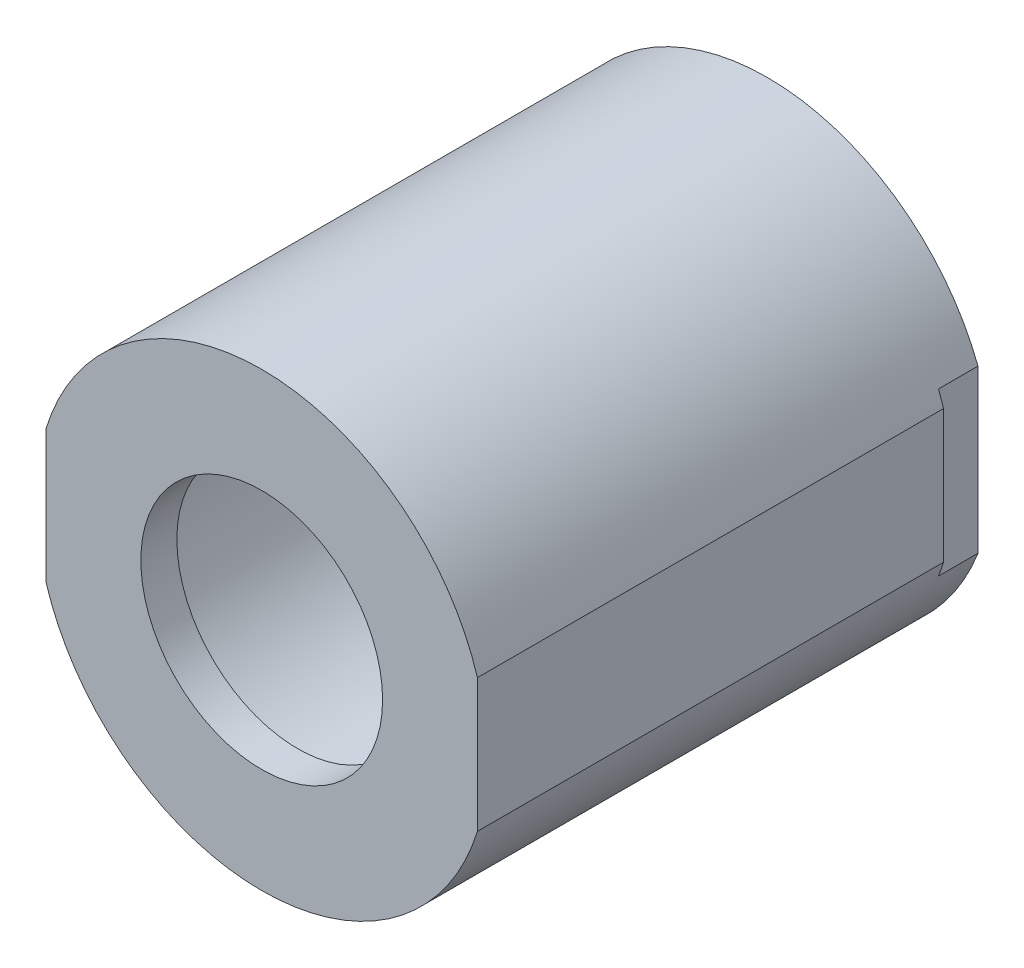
from build123d import *

# Parameters (mm, degrees)
SKETCH1_R           = 28.575
BOSS_EXTRUDE1_DEPTH = 64
CUT_EXTRUDE1_REACH  = 77.691
SKETCH2_R           = 15.3
SKETCH3_R           = 21.43125
CUT_EXTRUDE2_DEPTH  = 59
CUT_EXTRUDE3_DEPTH  = 76.69056249
CUT_EXTRUDE5_DEPTH  = 5


with BuildPart() as part:
    # Sketch1 → Boss-Extrude1 (new body)
    with BuildSketch(Plane.XY):
        Circle(SKETCH1_R)
    extrude(amount=BOSS_EXTRUDE1_DEPTH)

    # Sketch2 → Cut-Extrude1 (cut, up to next)
    with BuildSketch(Plane.XY.offset(64), mode=Mode.PRIVATE) as cut_extrude1_sk1:
        Circle(SKETCH2_R)
    cut_extrude1_tool1 = extrude(cut_extrude1_sk1.sketch, amount=-CUT_EXTRUDE1_REACH, mode=Mode.PRIVATE) & part.part
    add(cut_extrude1_tool1.solids().sort_by_distance((0, 0, 64))[0], mode=Mode.SUBTRACT)

    # Sketch3 → Cut-Extrude2 (cut)
    with BuildSketch(Plane(origin=(0, 0, 0), x_dir=(-1, 0, 0), z_dir=(0, 0, -1))):
        Circle(SKETCH3_R)
    extrude(amount=-CUT_EXTRUDE2_DEPTH, mode=Mode.SUBTRACT)

    # Sketch4 → Cut-Revolve1 (revolve, cut)
    with BuildSketch(Plane(origin=(0, 0, 0), x_dir=(1, 0, 0), z_dir=(0, 1, 0))):
        Polygon((17, -59), (15, -59.518725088), (15, -59), align=None)
    revolve(axis=Axis((0, 0, 0), (0, 0, 1)), mode=Mode.SUBTRACT)

    # Sketch5 → Cut-Extrude3 (cut, through all)
    with BuildSketch(Plane(origin=(0, 0, 0), x_dir=(-1, 0, 0), z_dir=(0, 0, -1))):
        with BuildLine():
            Line((-27.305, -8.424226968), (-27.305, 8.424226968))
            ThreePointArc((-27.305, 8.424226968), (-28.575, 0), (-27.305, -8.424226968))
        make_face()
        with BuildLine():
            Line((27.305, -8.424226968), (27.305, 8.424226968))
            ThreePointArc((27.305, 8.424226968), (28.575, 0), (27.305, -8.424226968))
        make_face()
    extrude(amount=-CUT_EXTRUDE3_DEPTH, mode=Mode.SUBTRACT)

    # Sketch7 → Cut-Extrude5 (cut)
    with BuildSketch(Plane(origin=(0, 0, 0), x_dir=(-1, 0, 0), z_dir=(0, 0, -1))):
        with BuildLine():
            Line((26.67, 10.258738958), (26.67, -10.258738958))
            ThreePointArc((26.67, -10.258738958), (28.575, 0), (26.67, 10.258738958))
        make_face()
        with BuildLine():
            Line((-26.67, 10.258738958), (-26.67, -10.258738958))
            ThreePointArc((-26.67, -10.258738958), (-28.575, 0), (-26.67, 10.258738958))
        make_face()
    extrude(amount=-CUT_EXTRUDE5_DEPTH, mode=Mode.SUBTRACT)


solid = part.part
